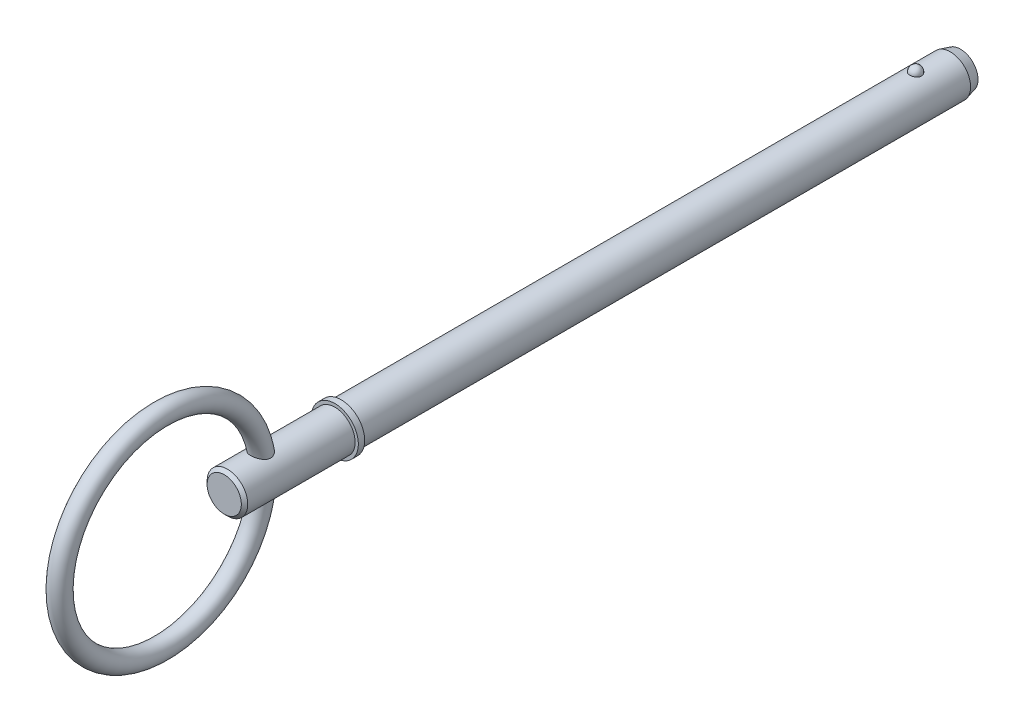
from build123d import *

# Parameters (mm, degrees)
SKETCH2_R           = 3.175
BOSS_EXTRUDE1_DEPTH = 88.9
BOSS_EXTRUDE2_START = 7.92
SKETCH3_R           = 3.175
BOSS_EXTRUDE2_DEPTH = 7.92
CHAMFER1_SIZE       = 1.586
CHAMFER1_SIZE2      = 0.424967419
SKETCH20_W          = 1
SKETCH20_H          = 3.675
SKETCH21_R          = 3.175
BOSS_EXTRUDE3_DEPTH = 18.29
CHAMFER2_SIZE       = 0.5
SKETCH24_R          = 1.5


with BuildPart() as part:
    # Sketch2 → Boss-Extrude1 (new body)
    with BuildSketch(Plane.XY):
        Circle(SKETCH2_R)
    extrude(amount=BOSS_EXTRUDE1_DEPTH)

    # Sketch3 → Boss-Extrude2 (add)
    with BuildSketch(Plane(origin=(0, 0, 0), x_dir=(-1, 0, 0), z_dir=(0, 0, -1)).offset(BOSS_EXTRUDE2_START)):
        Circle(SKETCH3_R)
    extrude(amount=-BOSS_EXTRUDE2_DEPTH)

    # Chamfer1
    chamfer1_edges = [part.edges().sort_by_distance(p)[0] for p in [
        (3.175, 0, -7.92),
    ]]
    chamfer1_side = [part.faces().sort_by_distance(p)[0] for p in [
        (3.175, 0, -3.96),
    ]]
    chamfer(chamfer1_edges, length=CHAMFER1_SIZE, length2=CHAMFER1_SIZE2, reference=chamfer1_side[0])

    # Sketch18 → Revolve1 (revolve)
    with BuildSketch(Plane(origin=(0, 0, 0), x_dir=(0, 0, -1), z_dir=(1, 0, 0))):
        with BuildLine():
            Line((0.91, 4.085), (0.91, 2.265))
            ThreePointArc((0.91, 2.265), (0, 3.175), (0.91, 4.085))
        make_face()
    revolve(axis=Axis((0, 4.085, -0.91), (0, -1, 0)))

    # Sketch20 → Revolve2 (revolve)
    with BuildSketch(Plane(origin=(0, 0, 0), x_dir=(0, 0, -1), z_dir=(1, 0, 0)), mode=Mode.PRIVATE) as revolve2_sk:
        with Locations((-89.4, 1.8375)):
            Rectangle(SKETCH20_W, SKETCH20_H)
    revolve(revolve2_sk.sketch.rotate(Axis((0, 0, 33.728787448), (0, 0, 1)), 90), axis=Axis((0, 0, 33.728787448), (0, 0, 1)))

    # Sketch21 → Boss-Extrude3 (add)
    with BuildSketch(Plane(origin=(0, 0, 88.9), x_dir=(-1, 0, 0), z_dir=(0, 0, -1))):
        Circle(SKETCH21_R)
    extrude(amount=-BOSS_EXTRUDE3_DEPTH)

    # Chamfer2
    chamfer2_edges = [part.edges().sort_by_distance(p)[0] for p in [
        (3.175, 0, 107.19),
    ]]
    chamfer(chamfer2_edges, length=CHAMFER2_SIZE)

    # Sweep1: sweep along a path in Sketch23
    with BuildLine(Plane(origin=(0, 0, 0), x_dir=(0, 0, -1), z_dir=(1, 0, 0))) as sweep1_path:
        CenterArc((-117.065, 0), 15.875, 0, 360)
    # Sketch24 → Sweep1 (sweep)
    with BuildSketch(Plane(origin=(0, 0, 0), x_dir=(1, 0, 0), z_dir=(0, 1, 0))):
        with Locations((0, -101.19)):
            Circle(SKETCH24_R)
    sweep(path=sweep1_path.line)


solid = part.part
